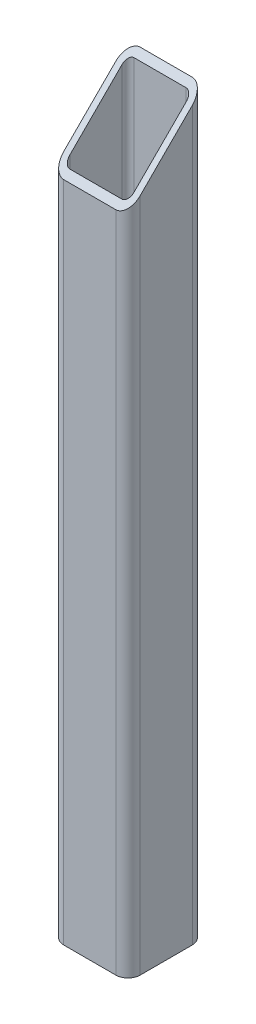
ISO-10303-21;
HEADER;
FILE_DESCRIPTION(('STEP AP214'),'2;1');
FILE_NAME('part.step','',(''),(''),'','','');
FILE_SCHEMA(('AUTOMOTIVE_DESIGN { 1 0 10303 214 1 1 1 1 }'));
ENDSEC;
DATA;
#1=APPLICATION_CONTEXT('core data for automotive mechanical design processes');
#2=APPLICATION_PROTOCOL_DEFINITION('international standard','automotive_design',2000,#1);
#3=PRODUCT_CONTEXT('',#1,'mechanical');
#4=PRODUCT('Part','Part','',(#3));
#5=PRODUCT_RELATED_PRODUCT_CATEGORY('part','',(#4));
#6=PRODUCT_DEFINITION_FORMATION('','',#4);
#7=PRODUCT_DEFINITION_CONTEXT('part definition',#1,'design');
#8=PRODUCT_DEFINITION('design','',#6,#7);
#9=PRODUCT_DEFINITION_SHAPE('','',#8);
#10=(LENGTH_UNIT() NAMED_UNIT(*) SI_UNIT(.MILLI.,.METRE.));
#11=(NAMED_UNIT(*) PLANE_ANGLE_UNIT() SI_UNIT($,.RADIAN.));
#12=(NAMED_UNIT(*) SI_UNIT($,.STERADIAN.) SOLID_ANGLE_UNIT());
#13=UNCERTAINTY_MEASURE_WITH_UNIT(LENGTH_MEASURE(1.E-05),#10,'distance_accuracy_value','');
#14=(GEOMETRIC_REPRESENTATION_CONTEXT(3) GLOBAL_UNCERTAINTY_ASSIGNED_CONTEXT((#13)) GLOBAL_UNIT_ASSIGNED_CONTEXT((#10,
#11,#12)) REPRESENTATION_CONTEXT('',''));
#15=CARTESIAN_POINT('',(0.,0.,0.));
#16=DIRECTION('',(0.,0.,1.));
#17=DIRECTION('',(1.,0.,0.));
#18=AXIS2_PLACEMENT_3D('',#15,#16,#17);
#19=CARTESIAN_POINT('',(-12.97432,368.3,-12.97432));
#20=DIRECTION('',(0.,-1.,0.));
#21=DIRECTION('',(0.,0.,-1.));
#22=AXIS2_PLACEMENT_3D('',#19,#20,#21);
#23=CYLINDRICAL_SURFACE('',#22,6.07568);
#24=CARTESIAN_POINT('',(-12.97432,362.22432,-12.97432));
#25=DIRECTION('',(0.,0.707106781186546,0.707106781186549));
#26=DIRECTION('',(0.,-0.707106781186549,0.707106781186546));
#27=AXIS2_PLACEMENT_3D('',#24,#25,#26);
#28=ELLIPSE('',#27,8.59230905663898,6.07568);
#29=CARTESIAN_POINT('',(-12.97432,368.3,-19.05));
#30=VERTEX_POINT('',#29);
#31=CARTESIAN_POINT('',(-19.05,362.22432,-12.97432));
#32=VERTEX_POINT('',#31);
#33=EDGE_CURVE('E210',#30,#32,#28,.T.);
#34=ORIENTED_EDGE('',*,*,#33,.F.);
#35=DIRECTION('',(0.,-1.,0.));
#36=VECTOR('',#35,1.);
#37=CARTESIAN_POINT('',(-12.97432,368.3,-19.05));
#38=LINE('',#37,#36);
#39=CARTESIAN_POINT('',(-12.97432,0.,-19.05));
#40=VERTEX_POINT('',#39);
#41=EDGE_CURVE('E195',#30,#40,#38,.T.);
#42=ORIENTED_EDGE('',*,*,#41,.T.);
#43=CARTESIAN_POINT('',(-12.97432,0.,-12.97432));
#44=DIRECTION('',(0.,1.,0.));
#45=DIRECTION('',(0.,0.,-1.));
#46=AXIS2_PLACEMENT_3D('',#43,#44,#45);
#47=CIRCLE('',#46,6.07568);
#48=CARTESIAN_POINT('',(-19.05,0.,-12.97432));
#49=VERTEX_POINT('',#48);
#50=EDGE_CURVE('E224',#40,#49,#47,.T.);
#51=ORIENTED_EDGE('',*,*,#50,.T.);
#52=DIRECTION('',(0.,-1.,0.));
#53=VECTOR('',#52,1.);
#54=CARTESIAN_POINT('',(-19.05,368.3,-12.97432));
#55=LINE('',#54,#53);
#56=EDGE_CURVE('E89',#32,#49,#55,.T.);
#57=ORIENTED_EDGE('',*,*,#56,.F.);
#58=EDGE_LOOP('',(#34,#42,#51,#57));
#59=FACE_BOUND('',#58,.T.);
#60=ADVANCED_FACE('F82',(#59),#23,.T.);
#61=CARTESIAN_POINT('',(-19.05,368.3,-12.97432));
#62=DIRECTION('',(1.,0.,0.));
#63=DIRECTION('',(0.,0.,-1.));
#64=AXIS2_PLACEMENT_3D('',#61,#62,#63);
#65=PLANE('',#64);
#66=DIRECTION('',(0.,-0.707106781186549,0.707106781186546));
#67=VECTOR('',#66,1.);
#68=CARTESIAN_POINT('',(-19.05,368.3,-19.05));
#69=LINE('',#68,#67);
#70=CARTESIAN_POINT('',(-19.05,336.27568,12.97432));
#71=VERTEX_POINT('',#70);
#72=EDGE_CURVE('E96',#32,#71,#69,.T.);
#73=ORIENTED_EDGE('',*,*,#72,.F.);
#74=ORIENTED_EDGE('',*,*,#56,.T.);
#75=DIRECTION('',(0.,0.,1.));
#76=VECTOR('',#75,1.);
#77=CARTESIAN_POINT('',(-19.05,0.,-12.97432));
#78=LINE('',#77,#76);
#79=CARTESIAN_POINT('',(-19.05,0.,12.97432));
#80=VERTEX_POINT('',#79);
#81=EDGE_CURVE('E226',#49,#80,#78,.T.);
#82=ORIENTED_EDGE('',*,*,#81,.T.);
#83=DIRECTION('',(0.,-1.,0.));
#84=VECTOR('',#83,1.);
#85=CARTESIAN_POINT('',(-19.05,368.3,12.97432));
#86=LINE('',#85,#84);
#87=EDGE_CURVE('E251',#71,#80,#86,.T.);
#88=ORIENTED_EDGE('',*,*,#87,.F.);
#89=EDGE_LOOP('',(#73,#74,#82,#88));
#90=FACE_BOUND('',#89,.T.);
#91=ADVANCED_FACE('F253',(#90),#65,.F.);
#92=CARTESIAN_POINT('',(-12.97432,368.3,12.97432));
#93=DIRECTION('',(0.,-1.,0.));
#94=DIRECTION('',(0.,0.,-1.));
#95=AXIS2_PLACEMENT_3D('',#92,#93,#94);
#96=CYLINDRICAL_SURFACE('',#95,6.07568);
#97=CARTESIAN_POINT('',(-12.97432,336.27568,12.97432));
#98=DIRECTION('',(0.,0.707106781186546,0.707106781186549));
#99=DIRECTION('',(0.,-0.707106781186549,0.707106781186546));
#100=AXIS2_PLACEMENT_3D('',#97,#98,#99);
#101=ELLIPSE('',#100,8.59230905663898,6.07568);
#102=CARTESIAN_POINT('',(-12.97432,330.2,19.05));
#103=VERTEX_POINT('',#102);
#104=EDGE_CURVE('E104',#71,#103,#101,.T.);
#105=ORIENTED_EDGE('',*,*,#104,.F.);
#106=ORIENTED_EDGE('',*,*,#87,.T.);
#107=CARTESIAN_POINT('',(-12.97432,0.,12.97432));
#108=DIRECTION('',(0.,1.,0.));
#109=DIRECTION('',(0.,0.,-1.));
#110=AXIS2_PLACEMENT_3D('',#107,#108,#109);
#111=CIRCLE('',#110,6.07568);
#112=CARTESIAN_POINT('',(-12.97432,0.,19.05));
#113=VERTEX_POINT('',#112);
#114=EDGE_CURVE('E229',#80,#113,#111,.T.);
#115=ORIENTED_EDGE('',*,*,#114,.T.);
#116=DIRECTION('',(0.,-1.,0.));
#117=VECTOR('',#116,1.);
#118=CARTESIAN_POINT('',(-12.97432,368.3,19.05));
#119=LINE('',#118,#117);
#120=EDGE_CURVE('E249',#103,#113,#119,.T.);
#121=ORIENTED_EDGE('',*,*,#120,.F.);
#122=EDGE_LOOP('',(#105,#106,#115,#121));
#123=FACE_BOUND('',#122,.T.);
#124=ADVANCED_FACE('F260',(#123),#96,.T.);
#125=CARTESIAN_POINT('',(-12.97432,368.3,19.05));
#126=DIRECTION('',(0.,0.,-1.));
#127=DIRECTION('',(-1.,0.,0.));
#128=AXIS2_PLACEMENT_3D('',#125,#126,#127);
#129=PLANE('',#128);
#130=DIRECTION('',(1.,0.,0.));
#131=VECTOR('',#130,1.);
#132=CARTESIAN_POINT('',(-19.05,330.2,19.05));
#133=LINE('',#132,#131);
#134=CARTESIAN_POINT('',(12.97432,330.2,19.05));
#135=VERTEX_POINT('',#134);
#136=EDGE_CURVE('E262',#103,#135,#133,.T.);
#137=ORIENTED_EDGE('',*,*,#136,.F.);
#138=ORIENTED_EDGE('',*,*,#120,.T.);
#139=DIRECTION('',(1.,0.,0.));
#140=VECTOR('',#139,1.);
#141=CARTESIAN_POINT('',(-12.97432,0.,19.05));
#142=LINE('',#141,#140);
#143=CARTESIAN_POINT('',(12.97432,0.,19.05));
#144=VERTEX_POINT('',#143);
#145=EDGE_CURVE('E232',#113,#144,#142,.T.);
#146=ORIENTED_EDGE('',*,*,#145,.T.);
#147=DIRECTION('',(0.,-1.,0.));
#148=VECTOR('',#147,1.);
#149=CARTESIAN_POINT('',(12.97432,368.3,19.05));
#150=LINE('',#149,#148);
#151=EDGE_CURVE('E247',#135,#144,#150,.T.);
#152=ORIENTED_EDGE('',*,*,#151,.F.);
#153=EDGE_LOOP('',(#137,#138,#146,#152));
#154=FACE_BOUND('',#153,.T.);
#155=ADVANCED_FACE('F377',(#154),#129,.F.);
#156=CARTESIAN_POINT('',(12.97432,368.3,12.97432));
#157=DIRECTION('',(0.,-1.,0.));
#158=DIRECTION('',(0.,0.,-1.));
#159=AXIS2_PLACEMENT_3D('',#156,#157,#158);
#160=CYLINDRICAL_SURFACE('',#159,6.07568);
#161=CARTESIAN_POINT('',(12.97432,336.27568,12.97432));
#162=DIRECTION('',(0.,0.707106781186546,0.707106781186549));
#163=DIRECTION('',(0.,-0.707106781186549,0.707106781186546));
#164=AXIS2_PLACEMENT_3D('',#161,#162,#163);
#165=ELLIPSE('',#164,8.59230905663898,6.07568);
#166=CARTESIAN_POINT('',(19.05,336.27568,12.97432));
#167=VERTEX_POINT('',#166);
#168=EDGE_CURVE('E290',#135,#167,#165,.T.);
#169=ORIENTED_EDGE('',*,*,#168,.F.);
#170=ORIENTED_EDGE('',*,*,#151,.T.);
#171=CARTESIAN_POINT('',(12.97432,0.,12.97432));
#172=DIRECTION('',(0.,1.,0.));
#173=DIRECTION('',(0.,0.,1.));
#174=AXIS2_PLACEMENT_3D('',#171,#172,#173);
#175=CIRCLE('',#174,6.07568);
#176=CARTESIAN_POINT('',(19.05,0.,12.97432));
#177=VERTEX_POINT('',#176);
#178=EDGE_CURVE('E235',#144,#177,#175,.T.);
#179=ORIENTED_EDGE('',*,*,#178,.T.);
#180=DIRECTION('',(0.,-1.,0.));
#181=VECTOR('',#180,1.);
#182=CARTESIAN_POINT('',(19.05,368.3,12.97432));
#183=LINE('',#182,#181);
#184=EDGE_CURVE('E245',#167,#177,#183,.T.);
#185=ORIENTED_EDGE('',*,*,#184,.F.);
#186=EDGE_LOOP('',(#169,#170,#179,#185));
#187=FACE_BOUND('',#186,.T.);
#188=ADVANCED_FACE('F382',(#187),#160,.T.);
#189=CARTESIAN_POINT('',(19.05,368.3,-12.97432));
#190=DIRECTION('',(-1.,0.,0.));
#191=DIRECTION('',(0.,0.,1.));
#192=AXIS2_PLACEMENT_3D('',#189,#190,#191);
#193=PLANE('',#192);
#194=DIRECTION('',(0.,0.707106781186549,-0.707106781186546));
#195=VECTOR('',#194,1.);
#196=CARTESIAN_POINT('',(19.05,365.26216,-16.01216));
#197=LINE('',#196,#195);
#198=CARTESIAN_POINT('',(19.05,362.22432,-12.97432));
#199=VERTEX_POINT('',#198);
#200=EDGE_CURVE('E288',#167,#199,#197,.T.);
#201=ORIENTED_EDGE('',*,*,#200,.F.);
#202=ORIENTED_EDGE('',*,*,#184,.T.);
#203=DIRECTION('',(0.,0.,-1.));
#204=VECTOR('',#203,1.);
#205=CARTESIAN_POINT('',(19.05,0.,-12.97432));
#206=LINE('',#205,#204);
#207=CARTESIAN_POINT('',(19.05,0.,-12.97432));
#208=VERTEX_POINT('',#207);
#209=EDGE_CURVE('E238',#177,#208,#206,.T.);
#210=ORIENTED_EDGE('',*,*,#209,.T.);
#211=DIRECTION('',(0.,-1.,0.));
#212=VECTOR('',#211,1.);
#213=CARTESIAN_POINT('',(19.05,368.3,-12.97432));
#214=LINE('',#213,#212);
#215=EDGE_CURVE('E243',#199,#208,#214,.T.);
#216=ORIENTED_EDGE('',*,*,#215,.F.);
#217=EDGE_LOOP('',(#201,#202,#210,#216));
#218=FACE_BOUND('',#217,.T.);
#219=ADVANCED_FACE('F386',(#218),#193,.F.);
#220=CARTESIAN_POINT('',(12.97432,368.3,-12.97432));
#221=DIRECTION('',(0.,-1.,0.));
#222=DIRECTION('',(0.,0.,-1.));
#223=AXIS2_PLACEMENT_3D('',#220,#221,#222);
#224=CYLINDRICAL_SURFACE('',#223,6.07568);
#225=CARTESIAN_POINT('',(12.97432,362.22432,-12.97432));
#226=DIRECTION('',(0.,0.707106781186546,0.707106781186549));
#227=DIRECTION('',(0.,-0.707106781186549,0.707106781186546));
#228=AXIS2_PLACEMENT_3D('',#225,#226,#227);
#229=ELLIPSE('',#228,8.59230905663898,6.07568);
#230=CARTESIAN_POINT('',(12.97432,368.3,-19.05));
#231=VERTEX_POINT('',#230);
#232=EDGE_CURVE('E216',#199,#231,#229,.T.);
#233=ORIENTED_EDGE('',*,*,#232,.F.);
#234=ORIENTED_EDGE('',*,*,#215,.T.);
#235=CARTESIAN_POINT('',(12.97432,0.,-12.97432));
#236=DIRECTION('',(0.,1.,0.));
#237=DIRECTION('',(0.,0.,-1.));
#238=AXIS2_PLACEMENT_3D('',#235,#236,#237);
#239=CIRCLE('',#238,6.07568);
#240=CARTESIAN_POINT('',(12.97432,0.,-19.05));
#241=VERTEX_POINT('',#240);
#242=EDGE_CURVE('E218',#208,#241,#239,.T.);
#243=ORIENTED_EDGE('',*,*,#242,.T.);
#244=DIRECTION('',(0.,-1.,0.));
#245=VECTOR('',#244,1.);
#246=CARTESIAN_POINT('',(12.97432,368.3,-19.05));
#247=LINE('',#246,#245);
#248=EDGE_CURVE('E207',#231,#241,#247,.T.);
#249=ORIENTED_EDGE('',*,*,#248,.F.);
#250=EDGE_LOOP('',(#233,#234,#243,#249));
#251=FACE_BOUND('',#250,.T.);
#252=ADVANCED_FACE('F390',(#251),#224,.T.);
#253=CARTESIAN_POINT('',(-12.97432,368.3,-12.97432));
#254=DIRECTION('',(0.,-1.,0.));
#255=DIRECTION('',(0.,0.,-1.));
#256=AXIS2_PLACEMENT_3D('',#253,#254,#255);
#257=CYLINDRICAL_SURFACE('',#256,3.03784);
#258=DIRECTION('',(0.,-1.,0.));
#259=VECTOR('',#258,1.);
#260=CARTESIAN_POINT('',(-12.97432,368.3,-16.01216));
#261=LINE('',#260,#259);
#262=CARTESIAN_POINT('',(-12.97432,365.26216,-16.01216));
#263=VERTEX_POINT('',#262);
#264=CARTESIAN_POINT('',(-12.97432,0.,-16.01216));
#265=VERTEX_POINT('',#264);
#266=EDGE_CURVE('E317',#263,#265,#261,.T.);
#267=ORIENTED_EDGE('',*,*,#266,.F.);
#268=CARTESIAN_POINT('',(-12.97432,362.22432,-12.97432));
#269=DIRECTION('',(0.,0.707106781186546,0.707106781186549));
#270=DIRECTION('',(0.,-0.707106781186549,0.707106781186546));
#271=AXIS2_PLACEMENT_3D('',#268,#269,#270);
#272=ELLIPSE('',#271,4.29615452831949,3.03784);
#273=CARTESIAN_POINT('',(-16.01216,362.22432,-12.97432));
#274=VERTEX_POINT('',#273);
#275=EDGE_CURVE('E284',#263,#274,#272,.T.);
#276=ORIENTED_EDGE('',*,*,#275,.T.);
#277=DIRECTION('',(0.,-1.,0.));
#278=VECTOR('',#277,1.);
#279=CARTESIAN_POINT('',(-16.01216,368.3,-12.97432));
#280=LINE('',#279,#278);
#281=CARTESIAN_POINT('',(-16.01216,0.,-12.97432));
#282=VERTEX_POINT('',#281);
#283=EDGE_CURVE('E222',#274,#282,#280,.T.);
#284=ORIENTED_EDGE('',*,*,#283,.T.);
#285=CARTESIAN_POINT('',(-12.97432,0.,-12.97432));
#286=DIRECTION('',(0.,-1.,0.));
#287=DIRECTION('',(-1.,0.,0.));
#288=AXIS2_PLACEMENT_3D('',#285,#286,#287);
#289=CIRCLE('',#288,3.03784);
#290=EDGE_CURVE('E212',#265,#282,#289,.F.);
#291=ORIENTED_EDGE('',*,*,#290,.F.);
#292=EDGE_LOOP('',(#267,#276,#284,#291));
#293=FACE_BOUND('',#292,.T.);
#294=ADVANCED_FACE('F337',(#293),#257,.F.);
#295=CARTESIAN_POINT('',(-16.01216,368.3,-12.97432));
#296=DIRECTION('',(1.,0.,0.));
#297=DIRECTION('',(0.,0.,-1.));
#298=AXIS2_PLACEMENT_3D('',#295,#296,#297);
#299=PLANE('',#298);
#300=ORIENTED_EDGE('',*,*,#283,.F.);
#301=DIRECTION('',(0.,-0.707106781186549,0.707106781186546));
#302=VECTOR('',#301,1.);
#303=CARTESIAN_POINT('',(-16.01216,365.26216,-16.01216));
#304=LINE('',#303,#302);
#305=CARTESIAN_POINT('',(-16.01216,336.27568,12.97432));
#306=VERTEX_POINT('',#305);
#307=EDGE_CURVE('E281',#274,#306,#304,.T.);
#308=ORIENTED_EDGE('',*,*,#307,.T.);
#309=DIRECTION('',(0.,-1.,0.));
#310=VECTOR('',#309,1.);
#311=CARTESIAN_POINT('',(-16.01216,368.3,12.97432));
#312=LINE('',#311,#310);
#313=CARTESIAN_POINT('',(-16.01216,0.,12.97432));
#314=VERTEX_POINT('',#313);
#315=EDGE_CURVE('E328',#306,#314,#312,.T.);
#316=ORIENTED_EDGE('',*,*,#315,.T.);
#317=DIRECTION('',(0.,0.,1.));
#318=VECTOR('',#317,1.);
#319=CARTESIAN_POINT('',(-16.01216,0.,-12.97432));
#320=LINE('',#319,#318);
#321=EDGE_CURVE('E296',#282,#314,#320,.T.);
#322=ORIENTED_EDGE('',*,*,#321,.F.);
#323=EDGE_LOOP('',(#300,#308,#316,#322));
#324=FACE_BOUND('',#323,.T.);
#325=ADVANCED_FACE('F338',(#324),#299,.T.);
#326=CARTESIAN_POINT('',(-12.97432,368.3,12.97432));
#327=DIRECTION('',(0.,-1.,0.));
#328=DIRECTION('',(0.,0.,-1.));
#329=AXIS2_PLACEMENT_3D('',#326,#327,#328);
#330=CYLINDRICAL_SURFACE('',#329,3.03784);
#331=ORIENTED_EDGE('',*,*,#315,.F.);
#332=CARTESIAN_POINT('',(-12.97432,336.27568,12.97432));
#333=DIRECTION('',(0.,0.707106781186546,0.707106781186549));
#334=DIRECTION('',(0.,-0.707106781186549,0.707106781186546));
#335=AXIS2_PLACEMENT_3D('',#332,#333,#334);
#336=ELLIPSE('',#335,4.29615452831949,3.03784);
#337=CARTESIAN_POINT('',(-12.97432,333.23784,16.01216));
#338=VERTEX_POINT('',#337);
#339=EDGE_CURVE('E278',#306,#338,#336,.T.);
#340=ORIENTED_EDGE('',*,*,#339,.T.);
#341=DIRECTION('',(0.,-1.,0.));
#342=VECTOR('',#341,1.);
#343=CARTESIAN_POINT('',(-12.97432,368.3,16.01216));
#344=LINE('',#343,#342);
#345=CARTESIAN_POINT('',(-12.97432,0.,16.01216));
#346=VERTEX_POINT('',#345);
#347=EDGE_CURVE('E327',#338,#346,#344,.T.);
#348=ORIENTED_EDGE('',*,*,#347,.T.);
#349=CARTESIAN_POINT('',(-12.97432,0.,12.97432));
#350=DIRECTION('',(0.,-1.,0.));
#351=DIRECTION('',(-1.,0.,0.));
#352=AXIS2_PLACEMENT_3D('',#349,#350,#351);
#353=CIRCLE('',#352,3.03784);
#354=EDGE_CURVE('E299',#314,#346,#353,.F.);
#355=ORIENTED_EDGE('',*,*,#354,.F.);
#356=EDGE_LOOP('',(#331,#340,#348,#355));
#357=FACE_BOUND('',#356,.T.);
#358=ADVANCED_FACE('F361',(#357),#330,.F.);
#359=CARTESIAN_POINT('',(-12.97432,368.3,16.01216));
#360=DIRECTION('',(0.,0.,-1.));
#361=DIRECTION('',(-1.,0.,0.));
#362=AXIS2_PLACEMENT_3D('',#359,#360,#361);
#363=PLANE('',#362);
#364=ORIENTED_EDGE('',*,*,#347,.F.);
#365=DIRECTION('',(1.,0.,0.));
#366=VECTOR('',#365,1.);
#367=CARTESIAN_POINT('',(-12.97432,333.23784,16.01216));
#368=LINE('',#367,#366);
#369=CARTESIAN_POINT('',(12.97432,333.23784,16.01216));
#370=VERTEX_POINT('',#369);
#371=EDGE_CURVE('E275',#338,#370,#368,.T.);
#372=ORIENTED_EDGE('',*,*,#371,.T.);
#373=DIRECTION('',(0.,-1.,0.));
#374=VECTOR('',#373,1.);
#375=CARTESIAN_POINT('',(12.97432,368.3,16.01216));
#376=LINE('',#375,#374);
#377=CARTESIAN_POINT('',(12.97432,0.,16.01216));
#378=VERTEX_POINT('',#377);
#379=EDGE_CURVE('E325',#370,#378,#376,.T.);
#380=ORIENTED_EDGE('',*,*,#379,.T.);
#381=DIRECTION('',(1.,0.,0.));
#382=VECTOR('',#381,1.);
#383=CARTESIAN_POINT('',(-12.97432,0.,16.01216));
#384=LINE('',#383,#382);
#385=EDGE_CURVE('E302',#346,#378,#384,.T.);
#386=ORIENTED_EDGE('',*,*,#385,.F.);
#387=EDGE_LOOP('',(#364,#372,#380,#386));
#388=FACE_BOUND('',#387,.T.);
#389=ADVANCED_FACE('F359',(#388),#363,.T.);
#390=CARTESIAN_POINT('',(12.97432,368.3,12.97432));
#391=DIRECTION('',(0.,-1.,0.));
#392=DIRECTION('',(0.,0.,-1.));
#393=AXIS2_PLACEMENT_3D('',#390,#391,#392);
#394=CYLINDRICAL_SURFACE('',#393,3.03784);
#395=ORIENTED_EDGE('',*,*,#379,.F.);
#396=CARTESIAN_POINT('',(12.97432,336.27568,12.97432));
#397=DIRECTION('',(0.,0.707106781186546,0.707106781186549));
#398=DIRECTION('',(0.,-0.707106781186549,0.707106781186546));
#399=AXIS2_PLACEMENT_3D('',#396,#397,#398);
#400=ELLIPSE('',#399,4.29615452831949,3.03784);
#401=CARTESIAN_POINT('',(16.01216,336.27568,12.97432));
#402=VERTEX_POINT('',#401);
#403=EDGE_CURVE('E272',#370,#402,#400,.T.);
#404=ORIENTED_EDGE('',*,*,#403,.T.);
#405=DIRECTION('',(0.,-1.,0.));
#406=VECTOR('',#405,1.);
#407=CARTESIAN_POINT('',(16.01216,368.3,12.97432));
#408=LINE('',#407,#406);
#409=CARTESIAN_POINT('',(16.01216,0.,12.97432));
#410=VERTEX_POINT('',#409);
#411=EDGE_CURVE('E323',#402,#410,#408,.T.);
#412=ORIENTED_EDGE('',*,*,#411,.T.);
#413=CARTESIAN_POINT('',(12.97432,0.,12.97432));
#414=DIRECTION('',(0.,-1.,0.));
#415=DIRECTION('',(-1.,0.,0.));
#416=AXIS2_PLACEMENT_3D('',#413,#414,#415);
#417=CIRCLE('',#416,3.03784);
#418=EDGE_CURVE('E305',#378,#410,#417,.F.);
#419=ORIENTED_EDGE('',*,*,#418,.F.);
#420=EDGE_LOOP('',(#395,#404,#412,#419));
#421=FACE_BOUND('',#420,.T.);
#422=ADVANCED_FACE('F354',(#421),#394,.F.);
#423=CARTESIAN_POINT('',(16.01216,368.3,-12.97432));
#424=DIRECTION('',(-1.,0.,0.));
#425=DIRECTION('',(0.,0.,1.));
#426=AXIS2_PLACEMENT_3D('',#423,#424,#425);
#427=PLANE('',#426);
#428=ORIENTED_EDGE('',*,*,#411,.F.);
#429=DIRECTION('',(0.,0.707106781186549,-0.707106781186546));
#430=VECTOR('',#429,1.);
#431=CARTESIAN_POINT('',(16.01216,365.26216,-16.01216));
#432=LINE('',#431,#430);
#433=CARTESIAN_POINT('',(16.01216,362.22432,-12.97432));
#434=VERTEX_POINT('',#433);
#435=EDGE_CURVE('E269',#402,#434,#432,.T.);
#436=ORIENTED_EDGE('',*,*,#435,.T.);
#437=DIRECTION('',(0.,-1.,0.));
#438=VECTOR('',#437,1.);
#439=CARTESIAN_POINT('',(16.01216,368.3,-12.97432));
#440=LINE('',#439,#438);
#441=CARTESIAN_POINT('',(16.01216,0.,-12.97432));
#442=VERTEX_POINT('',#441);
#443=EDGE_CURVE('E321',#434,#442,#440,.T.);
#444=ORIENTED_EDGE('',*,*,#443,.T.);
#445=DIRECTION('',(0.,0.,-1.));
#446=VECTOR('',#445,1.);
#447=CARTESIAN_POINT('',(16.01216,0.,-12.97432));
#448=LINE('',#447,#446);
#449=EDGE_CURVE('E308',#410,#442,#448,.T.);
#450=ORIENTED_EDGE('',*,*,#449,.F.);
#451=EDGE_LOOP('',(#428,#436,#444,#450));
#452=FACE_BOUND('',#451,.T.);
#453=ADVANCED_FACE('F351',(#452),#427,.T.);
#454=CARTESIAN_POINT('',(12.97432,368.3,-12.97432));
#455=DIRECTION('',(0.,-1.,0.));
#456=DIRECTION('',(0.,0.,-1.));
#457=AXIS2_PLACEMENT_3D('',#454,#455,#456);
#458=CYLINDRICAL_SURFACE('',#457,3.03784);
#459=ORIENTED_EDGE('',*,*,#443,.F.);
#460=CARTESIAN_POINT('',(12.97432,362.22432,-12.97432));
#461=DIRECTION('',(0.,0.707106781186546,0.707106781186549));
#462=DIRECTION('',(0.,-0.707106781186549,0.707106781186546));
#463=AXIS2_PLACEMENT_3D('',#460,#461,#462);
#464=ELLIPSE('',#463,4.29615452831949,3.03784);
#465=CARTESIAN_POINT('',(12.97432,365.26216,-16.01216));
#466=VERTEX_POINT('',#465);
#467=EDGE_CURVE('E264',#434,#466,#464,.T.);
#468=ORIENTED_EDGE('',*,*,#467,.T.);
#469=DIRECTION('',(0.,-1.,0.));
#470=VECTOR('',#469,1.);
#471=CARTESIAN_POINT('',(12.97432,368.3,-16.01216));
#472=LINE('',#471,#470);
#473=CARTESIAN_POINT('',(12.97432,0.,-16.01216));
#474=VERTEX_POINT('',#473);
#475=EDGE_CURVE('E319',#466,#474,#472,.T.);
#476=ORIENTED_EDGE('',*,*,#475,.T.);
#477=CARTESIAN_POINT('',(12.97432,0.,-12.97432));
#478=DIRECTION('',(0.,-1.,0.));
#479=DIRECTION('',(-1.,0.,0.));
#480=AXIS2_PLACEMENT_3D('',#477,#478,#479);
#481=CIRCLE('',#480,3.03784);
#482=EDGE_CURVE('E311',#442,#474,#481,.F.);
#483=ORIENTED_EDGE('',*,*,#482,.F.);
#484=EDGE_LOOP('',(#459,#468,#476,#483));
#485=FACE_BOUND('',#484,.T.);
#486=ADVANCED_FACE('F347',(#485),#458,.F.);
#487=CARTESIAN_POINT('',(-12.97432,368.3,-16.01216));
#488=DIRECTION('',(0.,0.,1.));
#489=DIRECTION('',(1.,0.,0.));
#490=AXIS2_PLACEMENT_3D('',#487,#488,#489);
#491=PLANE('',#490);
#492=ORIENTED_EDGE('',*,*,#475,.F.);
#493=DIRECTION('',(-1.,0.,0.));
#494=VECTOR('',#493,1.);
#495=CARTESIAN_POINT('',(-12.97432,365.26216,-16.01216));
#496=LINE('',#495,#494);
#497=EDGE_CURVE('E12',#466,#263,#496,.T.);
#498=ORIENTED_EDGE('',*,*,#497,.T.);
#499=ORIENTED_EDGE('',*,*,#266,.T.);
#500=DIRECTION('',(-1.,0.,0.));
#501=VECTOR('',#500,1.);
#502=CARTESIAN_POINT('',(-12.97432,0.,-16.01216));
#503=LINE('',#502,#501);
#504=EDGE_CURVE('E314',#474,#265,#503,.T.);
#505=ORIENTED_EDGE('',*,*,#504,.F.);
#506=EDGE_LOOP('',(#492,#498,#499,#505));
#507=FACE_BOUND('',#506,.T.);
#508=ADVANCED_FACE('F343',(#507),#491,.T.);
#509=CARTESIAN_POINT('',(-12.97432,0.,-12.97432));
#510=DIRECTION('',(0.,1.,0.));
#511=DIRECTION('',(0.,0.,1.));
#512=AXIS2_PLACEMENT_3D('',#509,#510,#511);
#513=PLANE('',#512);
#514=ORIENTED_EDGE('',*,*,#50,.F.);
#515=DIRECTION('',(-1.,0.,0.));
#516=VECTOR('',#515,1.);
#517=CARTESIAN_POINT('',(-12.97432,0.,-19.05));
#518=LINE('',#517,#516);
#519=EDGE_CURVE('E203',#241,#40,#518,.T.);
#520=ORIENTED_EDGE('',*,*,#519,.F.);
#521=ORIENTED_EDGE('',*,*,#242,.F.);
#522=ORIENTED_EDGE('',*,*,#209,.F.);
#523=ORIENTED_EDGE('',*,*,#178,.F.);
#524=ORIENTED_EDGE('',*,*,#145,.F.);
#525=ORIENTED_EDGE('',*,*,#114,.F.);
#526=ORIENTED_EDGE('',*,*,#81,.F.);
#527=EDGE_LOOP('',(#514,#520,#521,#522,#523,#524,#525,#526));
#528=FACE_BOUND('',#527,.T.);
#529=ORIENTED_EDGE('',*,*,#290,.T.);
#530=ORIENTED_EDGE('',*,*,#321,.T.);
#531=ORIENTED_EDGE('',*,*,#354,.T.);
#532=ORIENTED_EDGE('',*,*,#385,.T.);
#533=ORIENTED_EDGE('',*,*,#418,.T.);
#534=ORIENTED_EDGE('',*,*,#449,.T.);
#535=ORIENTED_EDGE('',*,*,#482,.T.);
#536=ORIENTED_EDGE('',*,*,#504,.T.);
#537=EDGE_LOOP('',(#529,#530,#531,#532,#533,#534,#535,#536));
#538=FACE_BOUND('',#537,.T.);
#539=ADVANCED_FACE('F256',(#528,#538),#513,.F.);
#540=CARTESIAN_POINT('',(-12.97432,368.3,-19.05));
#541=DIRECTION('',(0.,0.,1.));
#542=DIRECTION('',(1.,0.,0.));
#543=AXIS2_PLACEMENT_3D('',#540,#541,#542);
#544=PLANE('',#543);
#545=ORIENTED_EDGE('',*,*,#519,.T.);
#546=ORIENTED_EDGE('',*,*,#41,.F.);
#547=DIRECTION('',(-1.,0.,0.));
#548=VECTOR('',#547,1.);
#549=CARTESIAN_POINT('',(-12.97432,368.3,-19.05));
#550=LINE('',#549,#548);
#551=EDGE_CURVE('E200',#231,#30,#550,.T.);
#552=ORIENTED_EDGE('',*,*,#551,.F.);
#553=ORIENTED_EDGE('',*,*,#248,.T.);
#554=EDGE_LOOP('',(#545,#546,#552,#553));
#555=FACE_BOUND('',#554,.T.);
#556=ADVANCED_FACE('F197',(#555),#544,.F.);
#557=CARTESIAN_POINT('',(-19.05,368.3,-19.05));
#558=DIRECTION('',(0.,0.707106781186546,0.707106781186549));
#559=DIRECTION('',(0.,-0.707106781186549,0.707106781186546));
#560=AXIS2_PLACEMENT_3D('',#557,#558,#559);
#561=PLANE('',#560);
#562=ORIENTED_EDGE('',*,*,#275,.F.);
#563=ORIENTED_EDGE('',*,*,#497,.F.);
#564=ORIENTED_EDGE('',*,*,#467,.F.);
#565=ORIENTED_EDGE('',*,*,#435,.F.);
#566=ORIENTED_EDGE('',*,*,#403,.F.);
#567=ORIENTED_EDGE('',*,*,#371,.F.);
#568=ORIENTED_EDGE('',*,*,#339,.F.);
#569=ORIENTED_EDGE('',*,*,#307,.F.);
#570=EDGE_LOOP('',(#562,#563,#564,#565,#566,#567,#568,#569));
#571=FACE_BOUND('',#570,.T.);
#572=ORIENTED_EDGE('',*,*,#551,.T.);
#573=ORIENTED_EDGE('',*,*,#33,.T.);
#574=ORIENTED_EDGE('',*,*,#72,.T.);
#575=ORIENTED_EDGE('',*,*,#104,.T.);
#576=ORIENTED_EDGE('',*,*,#136,.T.);
#577=ORIENTED_EDGE('',*,*,#168,.T.);
#578=ORIENTED_EDGE('',*,*,#200,.T.);
#579=ORIENTED_EDGE('',*,*,#232,.T.);
#580=EDGE_LOOP('',(#572,#573,#574,#575,#576,#577,#578,#579));
#581=FACE_BOUND('',#580,.T.);
#582=ADVANCED_FACE('F214',(#571,#581),#561,.T.);
#583=CLOSED_SHELL('',(#60,#91,#124,#155,#188,#219,#252,#294,#325,#358,#389,#422,#453,#486,#508,
#539,#556,#582));
#584=MANIFOLD_SOLID_BREP('B2',#583);
#585=ADVANCED_BREP_SHAPE_REPRESENTATION('',(#18,#584),#14);
#586=SHAPE_DEFINITION_REPRESENTATION(#9,#585);
ENDSEC;
END-ISO-10303-21;
